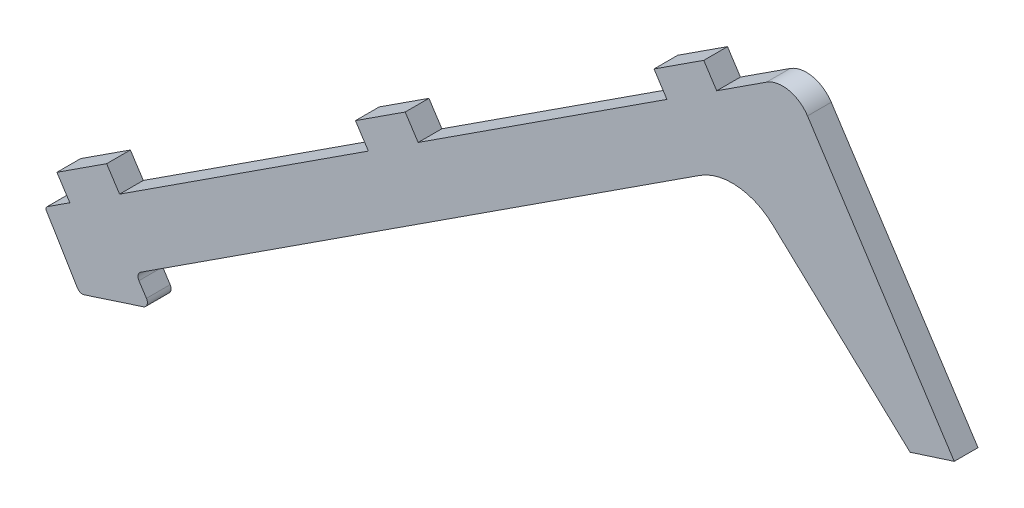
from build123d import *

# Parameters (mm, degrees)
BOSS_EXTRUDE1_DEPTH = 8


with BuildPart() as part:
    # Sketch1 → Boss-Extrude1 (new body)
    with BuildSketch(Plane.XY):
        with BuildLine():
            Line((39.535311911, 18.055857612), (130.3058604, 77.047432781))
            ThreePointArc((130.3058604, 77.047432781), (142.95048611, 80.201412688), (154.853758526, 74.896108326))
            Line((154.853758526, 74.896108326), (196.031751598, 36.447651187))
            Line((196.031751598, 36.447651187), (201.148167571, 31.67038339))
            Line((201.148167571, 31.67038339), (216.031751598, 36.447651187))
            Line((216.031751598, 36.447651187), (166.575897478, 112.545551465))
            ThreePointArc((166.575897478, 112.545551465), (160.266814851, 116.878462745), (152.741788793, 115.481098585))
            Line((152.741788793, 115.481098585), (135.972132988, 104.58253702))
            Line((135.972132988, 104.58253702), (131.612708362, 111.290399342))
            Line((131.612708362, 111.290399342), (114.843052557, 100.391837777))
            Line((114.843052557, 100.391837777), (119.202477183, 93.683975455))
            Line((119.202477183, 93.683975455), (35.354198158, 39.191167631))
            Line((35.354198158, 39.191167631), (30.994773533, 45.899029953))
            Line((30.994773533, 45.899029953), (14.225117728, 35.000468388))
            Line((14.225117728, 35.000468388), (18.584542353, 28.292606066))
            Line((18.584542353, 28.292606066), (-65.263736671, -26.200201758))
            Line((-65.263736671, -26.200201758), (-69.623161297, -19.492339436))
            Line((-69.623161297, -19.492339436), (-86.392817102, -30.390901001))
            Line((-86.392817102, -30.390901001), (-82.033392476, -37.098763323))
            Line((-82.033392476, -37.098763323), (-89.607335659, -42.021051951))
            ThreePointArc((-89.607335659, -42.021051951), (-90.037017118, -42.635623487), (-89.918651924, -43.376105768))
            Line((-89.918651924, -43.376105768), (-79.484919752, -60.670579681))
            ThreePointArc((-79.484919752, -60.670579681), (-78.471415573, -61.511316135), (-77.15489663, -61.539712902))
            Line((-77.15489663, -61.539712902), (-57.274704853, -55.086018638))
            ThreePointArc((-57.274704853, -55.086018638), (-56.006928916, -53.851279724), (-56.215273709, -52.093887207))
            Line((-56.215273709, -52.093887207), (-58.744923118, -48.201506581))
            ThreePointArc((-58.744923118, -48.201506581), (-59.02439595, -46.69650137), (-58.157813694, -45.434684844))
            Line((-58.157813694, -45.434684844), (39.535311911, 18.055857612))
        make_face()
    extrude(amount=BOSS_EXTRUDE1_DEPTH)


solid = part.part
